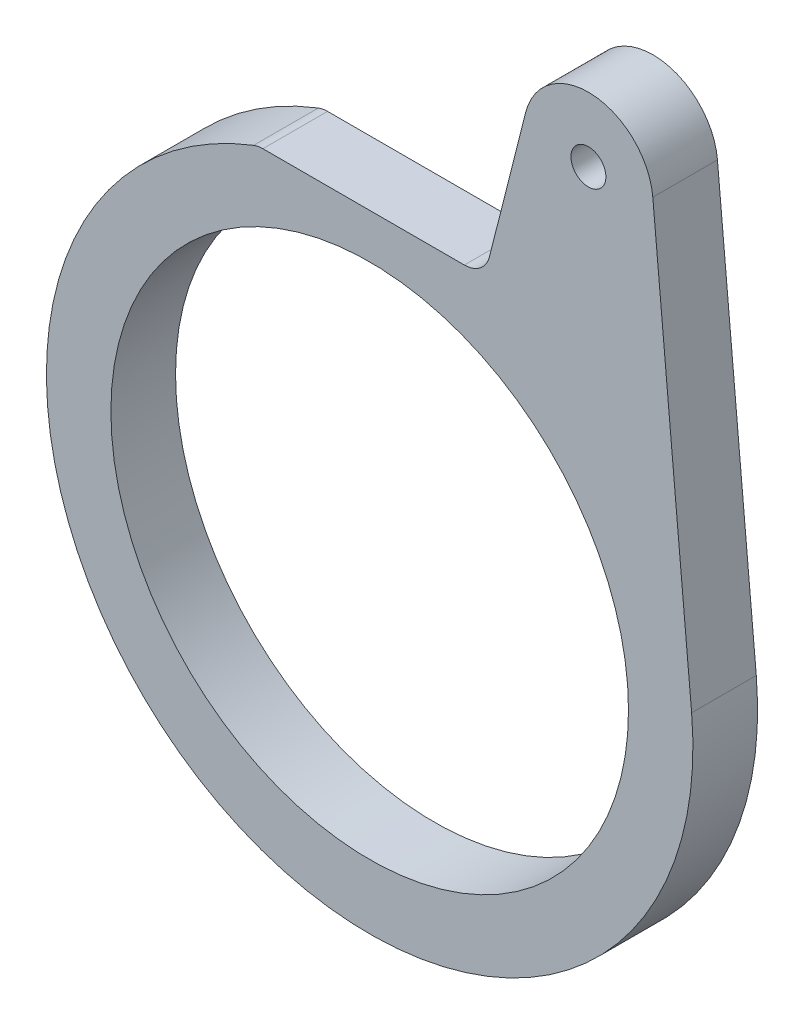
ISO-10303-21;
HEADER;
FILE_DESCRIPTION(('STEP AP214'),'2;1');
FILE_NAME('part.step','',(''),(''),'','','');
FILE_SCHEMA(('AUTOMOTIVE_DESIGN { 1 0 10303 214 1 1 1 1 }'));
ENDSEC;
DATA;
#1=APPLICATION_CONTEXT('core data for automotive mechanical design processes');
#2=APPLICATION_PROTOCOL_DEFINITION('international standard','automotive_design',2000,#1);
#3=PRODUCT_CONTEXT('',#1,'mechanical');
#4=PRODUCT('Part','Part','',(#3));
#5=PRODUCT_RELATED_PRODUCT_CATEGORY('part','',(#4));
#6=PRODUCT_DEFINITION_FORMATION('','',#4);
#7=PRODUCT_DEFINITION_CONTEXT('part definition',#1,'design');
#8=PRODUCT_DEFINITION('design','',#6,#7);
#9=PRODUCT_DEFINITION_SHAPE('','',#8);
#10=(LENGTH_UNIT() NAMED_UNIT(*) SI_UNIT(.MILLI.,.METRE.));
#11=(NAMED_UNIT(*) PLANE_ANGLE_UNIT() SI_UNIT($,.RADIAN.));
#12=(NAMED_UNIT(*) SI_UNIT($,.STERADIAN.) SOLID_ANGLE_UNIT());
#13=UNCERTAINTY_MEASURE_WITH_UNIT(LENGTH_MEASURE(1.E-05),#10,'distance_accuracy_value','');
#14=(GEOMETRIC_REPRESENTATION_CONTEXT(3) GLOBAL_UNCERTAINTY_ASSIGNED_CONTEXT((#13)) GLOBAL_UNIT_ASSIGNED_CONTEXT((#10,
#11,#12)) REPRESENTATION_CONTEXT('',''));
#15=CARTESIAN_POINT('',(0.,0.,0.));
#16=DIRECTION('',(0.,0.,1.));
#17=DIRECTION('',(1.,0.,0.));
#18=AXIS2_PLACEMENT_3D('',#15,#16,#17);
#19=CARTESIAN_POINT('',(0.,0.,6.35));
#20=DIRECTION('',(0.,0.,1.));
#21=DIRECTION('',(1.,0.,0.));
#22=AXIS2_PLACEMENT_3D('',#19,#20,#21);
#23=PLANE('',#22);
#24=CARTESIAN_POINT('',(42.9641,88.49568407,6.35));
#25=DIRECTION('',(0.,0.,1.));
#26=DIRECTION('',(1.,0.,0.));
#27=AXIS2_PLACEMENT_3D('',#24,#25,#26);
#28=CIRCLE('',#27,3.42900000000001);
#29=CARTESIAN_POINT('',(46.3931,88.49568407,6.35));
#30=VERTEX_POINT('',#29);
#31=EDGE_CURVE('E160',#30,#30,#28,.T.);
#32=ORIENTED_EDGE('',*,*,#31,.F.);
#33=EDGE_LOOP('',(#32));
#34=FACE_BOUND('',#33,.T.);
#35=DIRECTION('',(-1.,0.,0.));
#36=VECTOR('',#35,1.);
#37=CARTESIAN_POINT('',(22.5476305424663,59.6031560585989,6.35));
#38=LINE('',#37,#36);
#39=CARTESIAN_POINT('',(18.5935885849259,59.6031560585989,6.35));
#40=VERTEX_POINT('',#39);
#41=CARTESIAN_POINT('',(-20.9790813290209,59.6031560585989,6.35));
#42=VERTEX_POINT('',#41);
#43=EDGE_CURVE('E150',#40,#42,#38,.T.);
#44=ORIENTED_EDGE('',*,*,#43,.T.);
#45=CARTESIAN_POINT('',(-20.9790813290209,54.5231560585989,6.35));
#46=DIRECTION('',(0.,0.,1.));
#47=DIRECTION('',(1.,0.,0.));
#48=AXIS2_PLACEMENT_3D('',#45,#46,#47);
#49=CIRCLE('',#48,5.08);
#50=CARTESIAN_POINT('',(-22.8033492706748,59.2643000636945,6.35));
#51=VERTEX_POINT('',#50);
#52=EDGE_CURVE('E48',#42,#51,#49,.T.);
#53=ORIENTED_EDGE('',*,*,#52,.T.);
#54=CARTESIAN_POINT('',(0.,0.,6.35));
#55=DIRECTION('',(0.,0.,1.));
#56=DIRECTION('',(1.,0.,0.));
#57=AXIS2_PLACEMENT_3D('',#54,#55,#56);
#58=CIRCLE('',#57,63.5);
#59=CARTESIAN_POINT('',(63.2391966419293,5.74926152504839,6.35));
#60=VERTEX_POINT('',#59);
#61=EDGE_CURVE('E90',#51,#60,#58,.T.);
#62=ORIENTED_EDGE('',*,*,#61,.T.);
#63=DIRECTION('',(-0.0905395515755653,0.995892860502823,0.));
#64=VECTOR('',#63,1.);
#65=CARTESIAN_POINT('',(63.2391966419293,5.74926152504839,6.35));
#66=LINE('',#65,#64);
#67=CARTESIAN_POINT('',(55.6119393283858,89.6455363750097,6.35));
#68=VERTEX_POINT('',#67);
#69=EDGE_CURVE('E93',#60,#68,#66,.T.);
#70=ORIENTED_EDGE('',*,*,#69,.T.);
#71=CARTESIAN_POINT('',(42.9641,88.49568407,6.35));
#72=DIRECTION('',(0.,0.,1.));
#73=DIRECTION('',(1.,0.,0.));
#74=AXIS2_PLACEMENT_3D('',#71,#72,#73);
#75=CIRCLE('',#74,12.7);
#76=CARTESIAN_POINT('',(30.6526254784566,91.6129898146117,6.35));
#77=VERTEX_POINT('',#76);
#78=EDGE_CURVE('E106',#68,#77,#75,.T.);
#79=ORIENTED_EDGE('',*,*,#78,.T.);
#80=DIRECTION('',(-0.245457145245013,-0.969407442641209,0.));
#81=VECTOR('',#80,1.);
#82=CARTESIAN_POINT('',(30.6526254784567,91.6129898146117,6.35));
#83=LINE('',#82,#81);
#84=CARTESIAN_POINT('',(23.5181783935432,63.4362337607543,6.35));
#85=VERTEX_POINT('',#84);
#86=EDGE_CURVE('E151',#77,#85,#83,.T.);
#87=ORIENTED_EDGE('',*,*,#86,.T.);
#88=CARTESIAN_POINT('',(18.5935885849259,64.6831560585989,6.35));
#89=DIRECTION('',(0.,0.,1.));
#90=DIRECTION('',(1.,0.,0.));
#91=AXIS2_PLACEMENT_3D('',#88,#89,#90);
#92=CIRCLE('',#91,5.08);
#93=EDGE_CURVE('E11',#85,#40,#92,.F.);
#94=ORIENTED_EDGE('',*,*,#93,.T.);
#95=EDGE_LOOP('',(#44,#53,#62,#70,#79,#87,#94));
#96=FACE_BOUND('',#95,.T.);
#97=CARTESIAN_POINT('',(0.,0.,6.35));
#98=DIRECTION('',(0.,0.,1.));
#99=DIRECTION('',(1.,0.,0.));
#100=AXIS2_PLACEMENT_3D('',#97,#98,#99);
#101=CIRCLE('',#100,50.8381);
#102=CARTESIAN_POINT('',(50.8381,0.,6.35));
#103=VERTEX_POINT('',#102);
#104=EDGE_CURVE('E169',#103,#103,#101,.T.);
#105=ORIENTED_EDGE('',*,*,#104,.F.);
#106=EDGE_LOOP('',(#105));
#107=FACE_BOUND('',#106,.T.);
#108=ADVANCED_FACE('F33',(#34,#96,#107),#23,.T.);
#109=CARTESIAN_POINT('',(0.,0.,-6.35));
#110=DIRECTION('',(0.,0.,1.));
#111=DIRECTION('',(1.,0.,0.));
#112=AXIS2_PLACEMENT_3D('',#109,#110,#111);
#113=PLANE('',#112);
#114=CARTESIAN_POINT('',(0.,0.,-6.35));
#115=DIRECTION('',(0.,0.,1.));
#116=DIRECTION('',(1.,0.,0.));
#117=AXIS2_PLACEMENT_3D('',#114,#115,#116);
#118=CIRCLE('',#117,63.5);
#119=CARTESIAN_POINT('',(-22.8033492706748,59.2643000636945,-6.35));
#120=VERTEX_POINT('',#119);
#121=CARTESIAN_POINT('',(63.2391966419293,5.74926152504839,-6.35));
#122=VERTEX_POINT('',#121);
#123=EDGE_CURVE('E110',#120,#122,#118,.T.);
#124=ORIENTED_EDGE('',*,*,#123,.F.);
#125=CARTESIAN_POINT('',(-20.9790813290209,54.5231560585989,-6.35));
#126=DIRECTION('',(0.,0.,1.));
#127=DIRECTION('',(1.,0.,0.));
#128=AXIS2_PLACEMENT_3D('',#125,#126,#127);
#129=CIRCLE('',#128,5.08);
#130=CARTESIAN_POINT('',(-20.9790813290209,59.6031560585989,-6.35));
#131=VERTEX_POINT('',#130);
#132=EDGE_CURVE('E56',#120,#131,#129,.F.);
#133=ORIENTED_EDGE('',*,*,#132,.T.);
#134=DIRECTION('',(-1.,0.,0.));
#135=VECTOR('',#134,1.);
#136=CARTESIAN_POINT('',(22.5476305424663,59.6031560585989,-6.35));
#137=LINE('',#136,#135);
#138=CARTESIAN_POINT('',(18.5935885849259,59.6031560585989,-6.35));
#139=VERTEX_POINT('',#138);
#140=EDGE_CURVE('E97',#139,#131,#137,.T.);
#141=ORIENTED_EDGE('',*,*,#140,.F.);
#142=CARTESIAN_POINT('',(18.5935885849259,64.6831560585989,-6.35));
#143=DIRECTION('',(0.,0.,1.));
#144=DIRECTION('',(1.,0.,0.));
#145=AXIS2_PLACEMENT_3D('',#142,#143,#144);
#146=CIRCLE('',#145,5.08);
#147=CARTESIAN_POINT('',(23.5181783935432,63.4362337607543,-6.35));
#148=VERTEX_POINT('',#147);
#149=EDGE_CURVE('E41',#139,#148,#146,.T.);
#150=ORIENTED_EDGE('',*,*,#149,.T.);
#151=DIRECTION('',(-0.245457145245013,-0.969407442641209,0.));
#152=VECTOR('',#151,1.);
#153=CARTESIAN_POINT('',(30.6526254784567,91.6129898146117,-6.35));
#154=LINE('',#153,#152);
#155=CARTESIAN_POINT('',(30.6526254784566,91.6129898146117,-6.35));
#156=VERTEX_POINT('',#155);
#157=EDGE_CURVE('E134',#156,#148,#154,.T.);
#158=ORIENTED_EDGE('',*,*,#157,.F.);
#159=CARTESIAN_POINT('',(42.9641,88.49568407,-6.35));
#160=DIRECTION('',(0.,0.,1.));
#161=DIRECTION('',(1.,0.,0.));
#162=AXIS2_PLACEMENT_3D('',#159,#160,#161);
#163=CIRCLE('',#162,12.7);
#164=CARTESIAN_POINT('',(55.6119393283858,89.6455363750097,-6.35));
#165=VERTEX_POINT('',#164);
#166=EDGE_CURVE('E145',#165,#156,#163,.T.);
#167=ORIENTED_EDGE('',*,*,#166,.F.);
#168=DIRECTION('',(-0.0905395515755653,0.995892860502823,0.));
#169=VECTOR('',#168,1.);
#170=CARTESIAN_POINT('',(63.2391966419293,5.74926152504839,-6.35));
#171=LINE('',#170,#169);
#172=EDGE_CURVE('E159',#122,#165,#171,.T.);
#173=ORIENTED_EDGE('',*,*,#172,.F.);
#174=EDGE_LOOP('',(#124,#133,#141,#150,#158,#167,#173));
#175=FACE_BOUND('',#174,.T.);
#176=CARTESIAN_POINT('',(42.9641,88.49568407,-6.35));
#177=DIRECTION('',(0.,0.,1.));
#178=DIRECTION('',(1.,0.,0.));
#179=AXIS2_PLACEMENT_3D('',#176,#177,#178);
#180=CIRCLE('',#179,3.42900000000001);
#181=CARTESIAN_POINT('',(46.3931,88.49568407,-6.35));
#182=VERTEX_POINT('',#181);
#183=EDGE_CURVE('E166',#182,#182,#180,.T.);
#184=ORIENTED_EDGE('',*,*,#183,.T.);
#185=EDGE_LOOP('',(#184));
#186=FACE_BOUND('',#185,.T.);
#187=CARTESIAN_POINT('',(0.,0.,-6.35));
#188=DIRECTION('',(0.,0.,1.));
#189=DIRECTION('',(1.,0.,0.));
#190=AXIS2_PLACEMENT_3D('',#187,#188,#189);
#191=CIRCLE('',#190,50.8381);
#192=CARTESIAN_POINT('',(50.8381,0.,-6.35));
#193=VERTEX_POINT('',#192);
#194=EDGE_CURVE('E172',#193,#193,#191,.T.);
#195=ORIENTED_EDGE('',*,*,#194,.T.);
#196=EDGE_LOOP('',(#195));
#197=FACE_BOUND('',#196,.T.);
#198=ADVANCED_FACE('F131',(#175,#186,#197),#113,.F.);
#199=CARTESIAN_POINT('',(0.,0.,6.35));
#200=DIRECTION('',(0.,0.,-1.));
#201=DIRECTION('',(-1.,0.,0.));
#202=AXIS2_PLACEMENT_3D('',#199,#200,#201);
#203=CYLINDRICAL_SURFACE('',#202,63.5);
#204=ORIENTED_EDGE('',*,*,#61,.F.);
#205=DIRECTION('',(0.,0.,-1.));
#206=VECTOR('',#205,1.);
#207=CARTESIAN_POINT('',(-22.8033492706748,59.2643000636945,6.35));
#208=LINE('',#207,#206);
#209=EDGE_CURVE('E124',#51,#120,#208,.T.);
#210=ORIENTED_EDGE('',*,*,#209,.T.);
#211=ORIENTED_EDGE('',*,*,#123,.T.);
#212=DIRECTION('',(0.,0.,-1.));
#213=VECTOR('',#212,1.);
#214=CARTESIAN_POINT('',(63.2391966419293,5.74926152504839,6.35));
#215=LINE('',#214,#213);
#216=EDGE_CURVE('E102',#60,#122,#215,.T.);
#217=ORIENTED_EDGE('',*,*,#216,.F.);
#218=EDGE_LOOP('',(#204,#210,#211,#217));
#219=FACE_BOUND('',#218,.T.);
#220=ADVANCED_FACE('F108',(#219),#203,.T.);
#221=CARTESIAN_POINT('',(63.2391966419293,5.74926152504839,6.35));
#222=DIRECTION('',(-0.995892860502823,-0.0905395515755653,0.));
#223=DIRECTION('',(0.0905395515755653,-0.995892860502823,0.));
#224=AXIS2_PLACEMENT_3D('',#221,#222,#223);
#225=PLANE('',#224);
#226=ORIENTED_EDGE('',*,*,#172,.T.);
#227=DIRECTION('',(0.,0.,-1.));
#228=VECTOR('',#227,1.);
#229=CARTESIAN_POINT('',(55.6119393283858,89.6455363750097,6.35));
#230=LINE('',#229,#228);
#231=EDGE_CURVE('E104',#68,#165,#230,.T.);
#232=ORIENTED_EDGE('',*,*,#231,.F.);
#233=ORIENTED_EDGE('',*,*,#69,.F.);
#234=ORIENTED_EDGE('',*,*,#216,.T.);
#235=EDGE_LOOP('',(#226,#232,#233,#234));
#236=FACE_BOUND('',#235,.T.);
#237=ADVANCED_FACE('F101',(#236),#225,.F.);
#238=CARTESIAN_POINT('',(42.9641,88.49568407,6.35));
#239=DIRECTION('',(0.,0.,-1.));
#240=DIRECTION('',(-1.,0.,0.));
#241=AXIS2_PLACEMENT_3D('',#238,#239,#240);
#242=CYLINDRICAL_SURFACE('',#241,12.7);
#243=ORIENTED_EDGE('',*,*,#166,.T.);
#244=DIRECTION('',(0.,0.,-1.));
#245=VECTOR('',#244,1.);
#246=CARTESIAN_POINT('',(30.6526254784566,91.6129898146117,6.35));
#247=LINE('',#246,#245);
#248=EDGE_CURVE('E116',#77,#156,#247,.T.);
#249=ORIENTED_EDGE('',*,*,#248,.F.);
#250=ORIENTED_EDGE('',*,*,#78,.F.);
#251=ORIENTED_EDGE('',*,*,#231,.T.);
#252=EDGE_LOOP('',(#243,#249,#250,#251));
#253=FACE_BOUND('',#252,.T.);
#254=ADVANCED_FACE('F164',(#253),#242,.T.);
#255=CARTESIAN_POINT('',(30.6526254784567,91.6129898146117,6.35));
#256=DIRECTION('',(0.969407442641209,-0.245457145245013,0.));
#257=DIRECTION('',(0.245457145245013,0.969407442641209,0.));
#258=AXIS2_PLACEMENT_3D('',#255,#256,#257);
#259=PLANE('',#258);
#260=ORIENTED_EDGE('',*,*,#157,.T.);
#261=DIRECTION('',(0.,0.,-1.));
#262=VECTOR('',#261,1.);
#263=CARTESIAN_POINT('',(23.5181783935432,63.4362337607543,6.35));
#264=LINE('',#263,#262);
#265=EDGE_CURVE('E122',#148,#85,#264,.F.);
#266=ORIENTED_EDGE('',*,*,#265,.T.);
#267=ORIENTED_EDGE('',*,*,#86,.F.);
#268=ORIENTED_EDGE('',*,*,#248,.T.);
#269=EDGE_LOOP('',(#260,#266,#267,#268));
#270=FACE_BOUND('',#269,.T.);
#271=ADVANCED_FACE('F141',(#270),#259,.F.);
#272=CARTESIAN_POINT('',(22.5476305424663,59.6031560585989,6.35));
#273=DIRECTION('',(0.,-1.,0.));
#274=DIRECTION('',(1.,0.,0.));
#275=AXIS2_PLACEMENT_3D('',#272,#273,#274);
#276=PLANE('',#275);
#277=ORIENTED_EDGE('',*,*,#43,.F.);
#278=DIRECTION('',(0.,0.,-1.));
#279=VECTOR('',#278,1.);
#280=CARTESIAN_POINT('',(18.5935885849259,59.6031560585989,-6.35));
#281=LINE('',#280,#279);
#282=EDGE_CURVE('E114',#40,#139,#281,.T.);
#283=ORIENTED_EDGE('',*,*,#282,.T.);
#284=ORIENTED_EDGE('',*,*,#140,.T.);
#285=DIRECTION('',(0.,0.,-1.));
#286=VECTOR('',#285,1.);
#287=CARTESIAN_POINT('',(-20.9790813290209,59.6031560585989,6.35));
#288=LINE('',#287,#286);
#289=EDGE_CURVE('E112',#131,#42,#288,.F.);
#290=ORIENTED_EDGE('',*,*,#289,.T.);
#291=EDGE_LOOP('',(#277,#283,#284,#290));
#292=FACE_BOUND('',#291,.T.);
#293=ADVANCED_FACE('F153',(#292),#276,.F.);
#294=CARTESIAN_POINT('',(42.9641,88.49568407,6.35));
#295=DIRECTION('',(0.,0.,-1.));
#296=DIRECTION('',(-1.,0.,0.));
#297=AXIS2_PLACEMENT_3D('',#294,#295,#296);
#298=CYLINDRICAL_SURFACE('',#297,3.42900000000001);
#299=ORIENTED_EDGE('',*,*,#31,.T.);
#300=EDGE_LOOP('',(#299));
#301=FACE_BOUND('',#300,.T.);
#302=ORIENTED_EDGE('',*,*,#183,.F.);
#303=EDGE_LOOP('',(#302));
#304=FACE_BOUND('',#303,.T.);
#305=ADVANCED_FACE('F189',(#301,#304),#298,.F.);
#306=CARTESIAN_POINT('',(0.,0.,6.35));
#307=DIRECTION('',(0.,0.,-1.));
#308=DIRECTION('',(-1.,0.,0.));
#309=AXIS2_PLACEMENT_3D('',#306,#307,#308);
#310=CYLINDRICAL_SURFACE('',#309,50.8381);
#311=ORIENTED_EDGE('',*,*,#104,.T.);
#312=EDGE_LOOP('',(#311));
#313=FACE_BOUND('',#312,.T.);
#314=ORIENTED_EDGE('',*,*,#194,.F.);
#315=EDGE_LOOP('',(#314));
#316=FACE_BOUND('',#315,.T.);
#317=ADVANCED_FACE('F178',(#313,#316),#310,.F.);
#318=CARTESIAN_POINT('',(18.5935885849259,64.6831560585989,6.35));
#319=DIRECTION('',(0.,0.,1.));
#320=DIRECTION('',(1.,0.,0.));
#321=AXIS2_PLACEMENT_3D('',#318,#319,#320);
#322=CYLINDRICAL_SURFACE('',#321,5.08);
#323=ORIENTED_EDGE('',*,*,#93,.F.);
#324=ORIENTED_EDGE('',*,*,#265,.F.);
#325=ORIENTED_EDGE('',*,*,#149,.F.);
#326=ORIENTED_EDGE('',*,*,#282,.F.);
#327=EDGE_LOOP('',(#323,#324,#325,#326));
#328=FACE_BOUND('',#327,.T.);
#329=ADVANCED_FACE('F148',(#328),#322,.F.);
#330=CARTESIAN_POINT('',(-20.9790813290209,54.5231560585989,6.35));
#331=DIRECTION('',(0.,0.,-1.));
#332=DIRECTION('',(-1.,0.,0.));
#333=AXIS2_PLACEMENT_3D('',#330,#331,#332);
#334=CYLINDRICAL_SURFACE('',#333,5.08);
#335=ORIENTED_EDGE('',*,*,#52,.F.);
#336=ORIENTED_EDGE('',*,*,#289,.F.);
#337=ORIENTED_EDGE('',*,*,#132,.F.);
#338=ORIENTED_EDGE('',*,*,#209,.F.);
#339=EDGE_LOOP('',(#335,#336,#337,#338));
#340=FACE_BOUND('',#339,.T.);
#341=ADVANCED_FACE('F35',(#340),#334,.T.);
#342=CLOSED_SHELL('',(#108,#198,#220,#237,#254,#271,#293,#305,#317,#329,#341));
#343=MANIFOLD_SOLID_BREP('B2',#342);
#344=ADVANCED_BREP_SHAPE_REPRESENTATION('',(#18,#343),#14);
#345=SHAPE_DEFINITION_REPRESENTATION(#9,#344);
ENDSEC;
END-ISO-10303-21;
